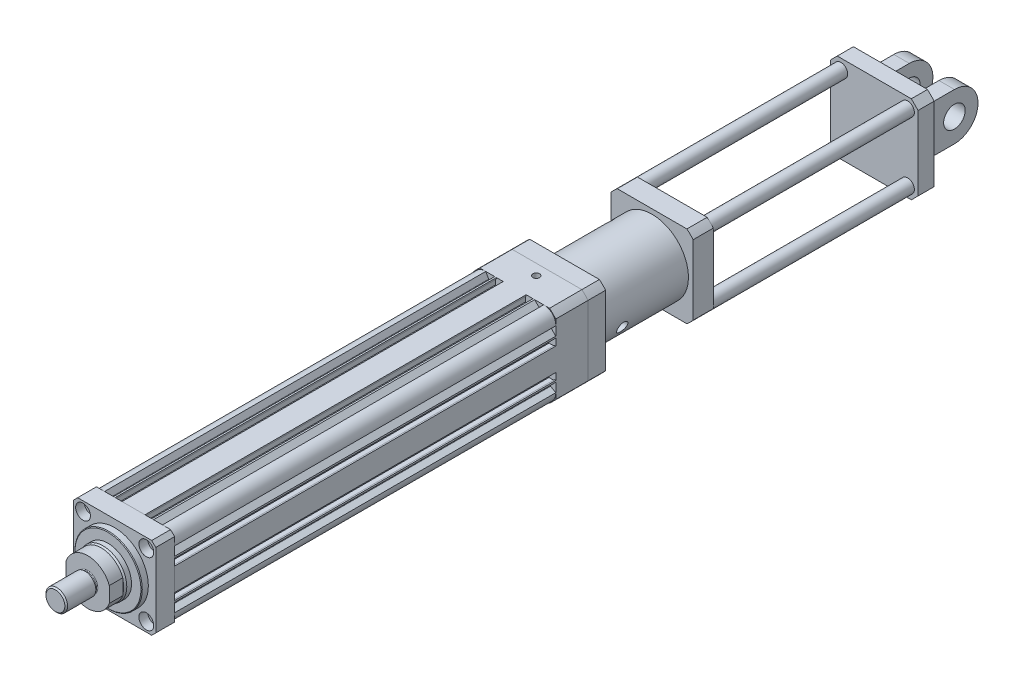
from build123d import *

# Parameters (mm, degrees)
SKETCH_1_R           = 25
SKETCH_1_R_2         = 2.594
EXTRUDE_1_DEPTH      = 283
EXTRUDE_1_2_DEPTH    = 14
SKETCH_3_R           = 4.5
SKETCH_3_R_2         = 3.5
CUT_EXTRUDE_3_DEPTH  = 14
SKETCH_3_5_R         = 5.5
CUT_EXTRUDE_4_DEPTH  = 6.5
SKETCH_5_R           = 25
EXTRUDE_2_DEPTH      = 5
CHAMFER_1_SIZE       = 0.5
SKETCH_6_R           = 17.5
EXTRUDE_3_DEPTH      = 5
CHAMFER_2_SIZE       = 1.5
CHAMFER_2_SIZE2      = 0.8
EXTRUDE_4_DEPTH      = 10
SKETCH_8_R           = 7
EXTRUDE_5_DEPTH      = 2
SKETCH_9_R           = 8
EXTRUDE_6_DEPTH      = 22
CHAMFER_3_SIZE       = 1
FILLET_1_R           = 0.5
SKETCH_10_W          = 61
SKETCH_10_H          = 61
EXTRUDE_7_DEPTH      = 24
SKETCH_11_R          = 50
SKETCH_11_R_2        = 40
CUT_EXTRUDE_1_DEPTH  = 24
SKETCH_16_W          = 61
SKETCH_16_H          = 61
EXTRUDE_8_DEPTH      = 13
SKETCH_18_R          = 3.5
CUT_EXTRUDE_5_DEPTH  = 13
SKETCH_19_R          = 27
EXTRUDE_9_DEPTH      = 65
SKETCH_20_W          = 61
SKETCH_20_H          = 61
EXTRUDE_10_DEPTH     = 15
SKETCH_21_R          = 2.5
CUT_EXTRUDE_6_DEPTH  = 10
SKETCH_22_R          = 50
SKETCH_22_R_2        = 40
CUT_EXTRUDE_2_DEPTH  = 93
SKETCH_23_R          = 21
CUT_EXTRUDE_7_DEPTH  = 80
SKETCH_23_3_R        = 25
CUT_EXTRUDE_8_DEPTH  = 7
SKETCH_24_R          = 4
CUT_EXTRUDE_9_DEPTH  = 27
SKETCH_25_R          = 4
CUT_EXTRUDE_10_DEPTH = 27
SKETCH_26_R          = 25
EXTRUDE_11_DEPTH     = 1
EXTRUDE_START        = 150
SKETCH_27_W          = 65
SKETCH_27_H          = 65
EXTRUDE_12_DEPTH     = 12
SKETCH_28_R          = 5
EXTRUDE_13_DEPTH     = 150
EXTRUDE_13_2_DEPTH   = 150
EXTRUDE_13_3_DEPTH   = 150
EXTRUDE_13_4_DEPTH   = 150
SKETCH_29_W          = 11.5
SKETCH_29_H          = 35
EXTRUDE_14_DEPTH     = 42.5
SKETCH_30_R          = 8
CUT_EXTRUDE_11_DEPTH = 52.5
CHAMFER_4_SIZE       = 2
CHAMFER_5_SIZE       = 5


with BuildPart() as part:
    # Sketch 1 → Extrude 1 (new body)
    with BuildSketch(Plane.XY):
        with BuildLine():
            Line((30.5, 8.5), (29.5, 8.5))
            Line((29.5, 8.5), (29.5, 7.9))
            Line((29.5, 7.9), (25.5, 7.9))
            Line((25.5, 7.9), (25.5, 14.2))
            Line((25.5, 14.2), (29.5, 14.2))
            Line((29.5, 14.2), (29.5, 13.6))
            Line((29.5, 13.6), (30.5, 13.6))
            Line((30.5, 13.6), (30.5, 14.843551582))
            Line((30.5, 14.843551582), (26.602512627, 18.741038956))
            ThreePointArc((26.602512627, 18.741038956), (26.502994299, 19.034210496), (26.675, 19.29163522))
            Line((26.675, 19.29163522), (30.5, 21.5))
            ThreePointArc((30.5, 21.5), (28.010599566, 28.010599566), (21.5, 30.5))
            Line((21.5, 30.5), (19.29163522, 26.675))
            ThreePointArc((19.29163522, 26.675), (19.034210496, 26.502994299), (18.741038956, 26.602512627))
            Line((18.741038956, 26.602512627), (14.843551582, 30.5))
            Line((14.843551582, 30.5), (13.6, 30.5))
            Line((13.6, 30.5), (13.6, 29.5))
            Line((13.6, 29.5), (14.2, 29.5))
            Line((14.2, 29.5), (14.2, 25.5))
            Line((14.2, 25.5), (7.9, 25.5))
            Line((7.9, 25.5), (7.9, 29.5))
            Line((7.9, 29.5), (8.5, 29.5))
            Line((8.5, 29.5), (8.5, 30.5))
            Line((8.5, 30.5), (-8.5, 30.5))
            Line((-8.5, 30.5), (-8.5, 29.5))
            Line((-8.5, 29.5), (-7.9, 29.5))
            Line((-7.9, 29.5), (-7.9, 25.5))
            Line((-7.9, 25.5), (-14.2, 25.5))
            Line((-14.2, 25.5), (-14.2, 29.5))
            Line((-14.2, 29.5), (-13.6, 29.5))
            Line((-13.6, 29.5), (-13.6, 30.5))
            Line((-13.6, 30.5), (-14.843551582, 30.5))
            Line((-14.843551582, 30.5), (-18.741038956, 26.602512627))
            ThreePointArc((-18.741038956, 26.602512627), (-19.034210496, 26.502994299), (-19.29163522, 26.675))
            Line((-19.29163522, 26.675), (-21.5, 30.5))
            ThreePointArc((-21.5, 30.5), (-28.010599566, 28.010599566), (-30.5, 21.5))
            Line((-30.5, 21.5), (-26.675, 19.29163522))
            ThreePointArc((-26.675, 19.29163522), (-26.502994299, 19.034210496), (-26.602512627, 18.741038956))
            Line((-26.602512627, 18.741038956), (-30.5, 14.843551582))
            Line((-30.5, 14.843551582), (-30.5, 13.6))
            Line((-30.5, 13.6), (-29.5, 13.6))
            Line((-29.5, 13.6), (-29.5, 14.2))
            Line((-29.5, 14.2), (-25.5, 14.2))
            Line((-25.5, 14.2), (-25.5, 7.9))
            Line((-25.5, 7.9), (-29.5, 7.9))
            Line((-29.5, 7.9), (-29.5, 8.5))
            Line((-29.5, 8.5), (-30.5, 8.5))
            Line((-30.5, 8.5), (-30.5, -8.5))
            Line((-30.5, -8.5), (-29.5, -8.5))
            Line((-29.5, -8.5), (-29.5, -7.9))
            Line((-29.5, -7.9), (-25.5, -7.9))
            Line((-25.5, -7.9), (-25.5, -14.2))
            Line((-25.5, -14.2), (-29.5, -14.2))
            Line((-29.5, -14.2), (-29.5, -13.6))
            Line((-29.5, -13.6), (-30.5, -13.6))
            Line((-30.5, -13.6), (-30.5, -14.843551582))
            Line((-30.5, -14.843551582), (-26.602512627, -18.741038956))
            ThreePointArc((-26.602512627, -18.741038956), (-26.502994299, -19.034210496), (-26.675, -19.29163522))
            Line((-26.675, -19.29163522), (-30.5, -21.5))
            ThreePointArc((-30.5, -21.5), (-27.825897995, -28.191225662), (-21, -30.5))
            Line((-21, -30.5), (-18.79163522, -26.675))
            ThreePointArc((-18.79163522, -26.675), (-18.534210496, -26.502994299), (-18.241038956, -26.602512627))
            Line((-18.241038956, -26.602512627), (-14.343551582, -30.5))
            Line((-14.343551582, -30.5), (14.343551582, -30.5))
            Line((14.343551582, -30.5), (18.241038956, -26.602512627))
            ThreePointArc((18.241038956, -26.602512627), (18.534210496, -26.502994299), (18.79163522, -26.675))
            Line((18.79163522, -26.675), (21, -30.5))
            ThreePointArc((21, -30.5), (27.825897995, -28.191225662), (30.5, -21.5))
            Line((30.5, -21.5), (26.675, -19.29163522))
            ThreePointArc((26.675, -19.29163522), (26.502994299, -19.034210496), (26.602512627, -18.741038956))
            Line((26.602512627, -18.741038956), (30.5, -14.843551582))
            Line((30.5, -14.843551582), (30.5, -13.6))
            Line((30.5, -13.6), (29.5, -13.6))
            Line((29.5, -13.6), (29.5, -14.2))
            Line((29.5, -14.2), (25.5, -14.2))
            Line((25.5, -14.2), (25.5, -7.9))
            Line((25.5, -7.9), (29.5, -7.9))
            Line((29.5, -7.9), (29.5, -8.5))
            Line((29.5, -8.5), (30.5, -8.5))
            Line((30.5, -8.5), (30.5, 8.5))
        make_face()
        Circle(SKETCH_1_R, mode=Mode.SUBTRACT)
        with Locations((23.5, -23.5)):
            Circle(SKETCH_1_R_2, mode=Mode.SUBTRACT)
        with Locations((-23.5, -23.5)):
            Circle(SKETCH_1_R_2, mode=Mode.SUBTRACT)
        with Locations((23.5, 23.5)):
            Circle(SKETCH_1_R_2, mode=Mode.SUBTRACT)
        with Locations((-23.5, 23.5)):
            Circle(SKETCH_1_R_2, mode=Mode.SUBTRACT)
        with BuildLine():
            Line((-14.843484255, -26.551505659), (-5.699422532, -26.551505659))
            ThreePointArc((-5.699422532, -26.551505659), (-5.401016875, -26.282393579), (-5.637974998, -25.957866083))
            ThreePointArc((-5.637974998, -25.957866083), (-10.496775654, -24.470016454), (-15.006657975, -22.128520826))
            ThreePointArc((-15.006657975, -22.128520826), (-15.31244973, -22.117932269), (-15.468484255, -22.381131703))
            Line((-15.468484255, -22.381131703), (-15.468484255, -25.926505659))
            Line((-15.468484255, -25.926505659), (-14.843484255, -26.551505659))
        make_face(mode=Mode.SUBTRACT)
        with BuildLine():
            Line((15.037740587, -26.551505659), (5.893678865, -26.551505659))
            ThreePointArc((5.893678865, -26.551505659), (5.595273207, -26.282393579), (5.832231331, -25.957866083))
            ThreePointArc((5.832231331, -25.957866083), (10.691031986, -24.470016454), (15.200914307, -22.128520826))
            ThreePointArc((15.200914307, -22.128520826), (15.506706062, -22.117932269), (15.662740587, -22.381131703))
            Line((15.662740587, -22.381131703), (15.662740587, -25.926505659))
            Line((15.662740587, -25.926505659), (15.037740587, -26.551505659))
        make_face(mode=Mode.SUBTRACT)
        with BuildLine():
            Line((24.057261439, -13.884764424), (23.358946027, -13.481591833))
            ThreePointArc((23.358946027, -13.481591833), (23.055418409, -13.441631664), (22.812535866, -13.628001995))
            Line((22.812535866, -13.628001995), (21.480305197, -15.935493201))
            ThreePointArc((21.480305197, -15.935493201), (21.440345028, -16.239020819), (21.626715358, -16.481903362))
            Line((21.626715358, -16.481903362), (22.892186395, -17.212523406))
            ThreePointArc((22.892186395, -17.212523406), (23.195714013, -17.252483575), (23.438596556, -17.066113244))
            Line((23.438596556, -17.066113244), (24.274264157, -15.618694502))
            ThreePointArc((24.274264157, -15.618694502), (24.317966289, -15.507082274), (24.326638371, -15.387533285))
            Line((24.326638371, -15.387533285), (24.223757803, -14.070923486))
            ThreePointArc((24.223757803, -14.070923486), (24.155411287, -13.964516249), (24.057261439, -13.884764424))
        make_face(mode=Mode.SUBTRACT)
        with BuildLine():
            Line((-24.057261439, -13.884764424), (-23.358946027, -13.481591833))
            ThreePointArc((-23.358946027, -13.481591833), (-23.055418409, -13.441631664), (-22.812535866, -13.628001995))
            Line((-22.812535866, -13.628001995), (-21.480305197, -15.935493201))
            ThreePointArc((-21.480305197, -15.935493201), (-21.440345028, -16.239020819), (-21.626715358, -16.481903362))
            Line((-21.626715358, -16.481903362), (-22.892186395, -17.212523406))
            ThreePointArc((-22.892186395, -17.212523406), (-23.195714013, -17.252483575), (-23.438596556, -17.066113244))
            Line((-23.438596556, -17.066113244), (-24.274264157, -15.618694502))
            ThreePointArc((-24.274264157, -15.618694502), (-24.317966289, -15.507082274), (-24.326638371, -15.387533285))
            Line((-24.326638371, -15.387533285), (-24.223757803, -14.070923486))
            ThreePointArc((-24.223757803, -14.070923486), (-24.155411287, -13.964516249), (-24.057261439, -13.884764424))
        make_face(mode=Mode.SUBTRACT)
        with BuildLine():
            Line((24.057261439, 13.884764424), (23.358946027, 13.481591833))
            ThreePointArc((23.358946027, 13.481591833), (23.055418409, 13.441631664), (22.812535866, 13.628001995))
            Line((22.812535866, 13.628001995), (21.480305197, 15.935493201))
            ThreePointArc((21.480305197, 15.935493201), (21.440345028, 16.239020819), (21.626715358, 16.481903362))
            Line((21.626715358, 16.481903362), (22.892186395, 17.212523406))
            ThreePointArc((22.892186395, 17.212523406), (23.195714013, 17.252483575), (23.438596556, 17.066113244))
            Line((23.438596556, 17.066113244), (24.274264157, 15.618694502))
            ThreePointArc((24.274264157, 15.618694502), (24.317966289, 15.507082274), (24.326638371, 15.387533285))
            Line((24.326638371, 15.387533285), (24.223757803, 14.070923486))
            ThreePointArc((24.223757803, 14.070923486), (24.155411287, 13.964516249), (24.057261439, 13.884764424))
        make_face(mode=Mode.SUBTRACT)
        with BuildLine():
            Line((-24.057261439, 13.884764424), (-23.358946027, 13.481591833))
            ThreePointArc((-23.358946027, 13.481591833), (-23.055418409, 13.441631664), (-22.812535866, 13.628001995))
            Line((-22.812535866, 13.628001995), (-21.480305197, 15.935493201))
            ThreePointArc((-21.480305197, 15.935493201), (-21.440345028, 16.239020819), (-21.626715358, 16.481903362))
            Line((-21.626715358, 16.481903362), (-22.892186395, 17.212523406))
            ThreePointArc((-22.892186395, 17.212523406), (-23.195714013, 17.252483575), (-23.438596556, 17.066113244))
            Line((-23.438596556, 17.066113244), (-24.274264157, 15.618694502))
            ThreePointArc((-24.274264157, 15.618694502), (-24.317966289, 15.507082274), (-24.326638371, 15.387533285))
            Line((-24.326638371, 15.387533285), (-24.223757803, 14.070923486))
            ThreePointArc((-24.223757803, 14.070923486), (-24.155411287, 13.964516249), (-24.057261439, 13.884764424))
        make_face(mode=Mode.SUBTRACT)
        with BuildLine():
            Line((17.761634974, 23.75411276), (17.07315308, 24.68624059))
            ThreePointArc((17.07315308, 24.68624059), (16.934629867, 24.812286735), (16.758415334, 24.87572765))
            Line((16.758415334, 24.87572765), (13.966108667, 25.295529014))
            ThreePointArc((13.966108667, 25.295529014), (13.689318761, 25.25468305), (13.482325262, 25.066441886))
            Line((13.482325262, 25.066441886), (12.839111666, 23.986237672))
            ThreePointArc((12.839111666, 23.986237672), (12.785382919, 23.626185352), (12.999780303, 23.331977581))
            ThreePointArc((12.999780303, 23.331977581), (14.833000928, 22.112125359), (16.576342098, 20.766949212))
            ThreePointArc((16.576342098, 20.766949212), (17.053890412, 20.688035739), (17.357364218, 21.065107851))
            Line((17.357364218, 21.065107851), (17.761634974, 23.75411276))
        make_face(mode=Mode.SUBTRACT)
        with BuildLine():
            Line((-17.761634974, 23.75411276), (-17.07315308, 24.68624059))
            ThreePointArc((-17.07315308, 24.68624059), (-16.934629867, 24.812286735), (-16.758415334, 24.87572765))
            Line((-16.758415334, 24.87572765), (-13.966108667, 25.295529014))
            ThreePointArc((-13.966108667, 25.295529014), (-13.689318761, 25.25468305), (-13.482325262, 25.066441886))
            Line((-13.482325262, 25.066441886), (-12.839111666, 23.986237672))
            ThreePointArc((-12.839111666, 23.986237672), (-12.785382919, 23.626185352), (-12.999780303, 23.331977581))
            ThreePointArc((-12.999780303, 23.331977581), (-14.833000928, 22.112125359), (-16.576342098, 20.766949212))
            ThreePointArc((-16.576342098, 20.766949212), (-17.053890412, 20.688035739), (-17.357364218, 21.065107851))
            Line((-17.357364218, 21.065107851), (-17.761634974, 23.75411276))
        make_face(mode=Mode.SUBTRACT)
    extrude(amount=EXTRUDE_1_DEPTH)

    # Sketch 10 → Extrude 7 (add)
    with BuildSketch(Plane(origin=(0, 0, 0), x_dir=(-1, 0, 0), z_dir=(0, 0, -1))):
        Rectangle(SKETCH_10_W, SKETCH_10_H)
    extrude(amount=EXTRUDE_7_DEPTH)

    # Sketch 11 → Cut-Extrude 1 (cut)
    with BuildSketch(Plane(origin=(0, 0, -24), x_dir=(-1, 0, 0), z_dir=(0, 0, -1))):
        Circle(SKETCH_11_R)
        Circle(SKETCH_11_R_2, mode=Mode.SUBTRACT)
    extrude(amount=-CUT_EXTRUDE_1_DEPTH, mode=Mode.SUBTRACT)

    # Sketch 15 → Hole Wizard M6 _1 (revolve, cut)
    with BuildSketch(Plane(origin=(0, 30.5, -16), x_dir=(0, 0, 1), z_dir=(1, 0, 0))):
        Polygon((0, 0), (0, 9.502151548), (2.5, 8), (2.5, 0), align=None)
    revolve(axis=Axis((0, 36.85, -16), (0, -1, 0)), mode=Mode.SUBTRACT)


with BuildPart() as body_2:
    # Sketch 2 → Extrude 1 2 (new body)
    with BuildSketch(Plane.XY.offset(283)):
        Polygon((-27.5, 30.5), (-30.5, 27.5), (-30.5, -27.5), (-27.5, -30.5), (27.5, -30.5), (30.5, -27.5), (30.5, 27.5), (27.5, 30.5), align=None)
    extrude(amount=EXTRUDE_1_2_DEPTH)

    # Sketch 3 → Cut-Extrude 3 (cut)
    with BuildSketch(Plane.XY.offset(297)):
        with Locations((-40, -20)):
            Circle(SKETCH_3_R)
        with Locations((-23.5, -23.5)):
            Circle(SKETCH_3_R_2)
        with Locations((-23.5, 23.5)):
            Circle(SKETCH_3_R_2)
        with Locations((23.5, 23.5)):
            Circle(SKETCH_3_R_2)
        with Locations((40, 20)):
            Circle(SKETCH_3_R)
        with Locations((40, -20)):
            Circle(SKETCH_3_R)
        with Locations((23.5, -23.5)):
            Circle(SKETCH_3_R_2)
        with Locations((-40, 20)):
            Circle(SKETCH_3_R)
    extrude(amount=-CUT_EXTRUDE_3_DEPTH, mode=Mode.SUBTRACT)

    # Sketch 3_5 → Cut-Extrude 4 (cut)
    with BuildSketch(Plane.XY.offset(297)):
        with Locations((-23.5, 23.5)):
            Circle(SKETCH_3_5_R)
        with Locations((-23.5, -23.5)):
            Circle(SKETCH_3_5_R)
        with Locations((23.5, -23.5)):
            Circle(SKETCH_3_5_R)
        with Locations((23.5, 23.5)):
            Circle(SKETCH_3_5_R)
    extrude(amount=-CUT_EXTRUDE_4_DEPTH, mode=Mode.SUBTRACT)

    # Sketch 5 → Extrude 2 (add)
    with BuildSketch(Plane.XY.offset(297)):
        Circle(SKETCH_5_R)
    extrude(amount=EXTRUDE_2_DEPTH)

    # Chamfer 1
    chamfer_1_edges = [body_2.edges().sort_by_distance(p)[0] for p in [
        (-25, 0, 302),
    ]]
    chamfer(chamfer_1_edges, length=CHAMFER_1_SIZE)

    # Sketch 6 → Extrude 3 (add)
    with BuildSketch(Plane.XY.offset(302)):
        Circle(SKETCH_6_R)
    extrude(amount=EXTRUDE_3_DEPTH)

    # Chamfer 2
    chamfer_2_edges = [body_2.edges().sort_by_distance(p)[0] for p in [
        (-17.5, 0, 307),
    ]]
    chamfer_2_side = [body_2.faces().sort_by_distance(p)[0] for p in [
        (-17.5, 0, 304.5),
    ]]
    chamfer(chamfer_2_edges, length=CHAMFER_2_SIZE, length2=CHAMFER_2_SIZE2, reference=chamfer_2_side[0])

    # Sketch 7 → Extrude 4 (add)
    with BuildSketch(Plane.XY.offset(307)):
        with BuildLine():
            Line((-16, 5.744562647), (-16, -5.744562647))
            ThreePointArc((-16, -5.744562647), (0, -17), (16, -5.744562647))
            Line((16, -5.744562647), (16, 5.744562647))
            ThreePointArc((16, 5.744562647), (0, 17), (-16, 5.744562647))
        make_face()
    extrude(amount=EXTRUDE_4_DEPTH)

    # Sketch 8 → Extrude 5 (add)
    with BuildSketch(Plane.XY.offset(317)):
        Circle(SKETCH_8_R)
    extrude(amount=EXTRUDE_5_DEPTH)

    # Sketch 9 → Extrude 6 (add)
    with BuildSketch(Plane.XY.offset(319)):
        Circle(SKETCH_9_R)
    extrude(amount=EXTRUDE_6_DEPTH)

    # Chamfer 3
    chamfer_3_edges = [body_2.edges().sort_by_distance(p)[0] for p in [
        (-8, 0, 341),
    ]]
    chamfer(chamfer_3_edges, length=CHAMFER_3_SIZE)

    # Fillet 1
    fillet_1_edges = [body_2.edges().sort_by_distance(p)[0] for p in [
        (-7, 0, 317),
    ]]
    fillet(fillet_1_edges, radius=FILLET_1_R)


with BuildPart() as body_3:
    # Sketch 16 → Extrude 8 (new body)
    with BuildSketch(Plane(origin=(0, 0, -24), x_dir=(-1, 0, 0), z_dir=(0, 0, -1))):
        Rectangle(SKETCH_16_W, SKETCH_16_H)
    extrude(amount=EXTRUDE_8_DEPTH)

    # Sketch 18 → Cut-Extrude 5 (cut)
    with BuildSketch(Plane(origin=(0, 0, -37), x_dir=(-1, 0, 0), z_dir=(0, 0, -1))):
        with Locations((-23.5, 23.5)):
            Circle(SKETCH_18_R)
        with Locations((-23.5, -23.5)):
            Circle(SKETCH_18_R)
        with Locations((23.5, -23.5)):
            Circle(SKETCH_18_R)
        with Locations((23.5, 23.5)):
            Circle(SKETCH_18_R)
    extrude(amount=-CUT_EXTRUDE_5_DEPTH, mode=Mode.SUBTRACT)

    # Sketch 19 → Extrude 9 (add)
    with BuildSketch(Plane(origin=(0, 0, -37), x_dir=(-1, 0, 0), z_dir=(0, 0, -1))):
        Circle(SKETCH_19_R)
    extrude(amount=EXTRUDE_9_DEPTH)

    # Sketch 20 → Extrude 10 (add)
    with BuildSketch(Plane(origin=(0, 0, -102), x_dir=(-1, 0, 0), z_dir=(0, 0, -1))):
        Rectangle(SKETCH_20_W, SKETCH_20_H)
    extrude(amount=EXTRUDE_10_DEPTH)

    # Sketch 21 → Cut-Extrude 6 (cut)
    with BuildSketch(Plane(origin=(0, 0, -117), x_dir=(-1, 0, 0), z_dir=(0, 0, -1))):
        with Locations((-24.748737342, 24.748737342)):
            Circle(SKETCH_21_R)
        with Locations((24.748737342, 24.748737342)):
            Circle(SKETCH_21_R)
        with Locations((24.748737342, -24.748737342)):
            Circle(SKETCH_21_R)
        with Locations((-24.748737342, -24.748737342)):
            Circle(SKETCH_21_R)
    extrude(amount=-CUT_EXTRUDE_6_DEPTH, mode=Mode.SUBTRACT)

    # Sketch 22 → Cut-Extrude 2 (cut)
    with BuildSketch(Plane(origin=(0, 0, -117), x_dir=(-1, 0, 0), z_dir=(0, 0, -1))):
        Circle(SKETCH_22_R)
        Circle(SKETCH_22_R_2, mode=Mode.SUBTRACT)
    extrude(amount=-CUT_EXTRUDE_2_DEPTH, mode=Mode.SUBTRACT)

    # Sketch 23 → Cut-Extrude 7 (cut)
    with BuildSketch(Plane(origin=(0, 0, -117), x_dir=(-1, 0, 0), z_dir=(0, 0, -1))):
        Circle(SKETCH_23_R)
    extrude(amount=-CUT_EXTRUDE_7_DEPTH, mode=Mode.SUBTRACT)

    # Sketch 23_3 → Cut-Extrude 8 (cut)
    with BuildSketch(Plane(origin=(0, 0, -117), x_dir=(-1, 0, 0), z_dir=(0, 0, -1))):
        Circle(SKETCH_23_3_R)
    extrude(amount=-CUT_EXTRUDE_8_DEPTH, mode=Mode.SUBTRACT)

    # Sketch 24 → Cut-Extrude 9 (cut)
    with BuildSketch(Plane.ZY.offset(30.5)):
        with Locations(Location((-88.78323725, 17.446251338, 0), (0, 0, 270))):
            Circle(SKETCH_24_R)
    extrude(amount=-CUT_EXTRUDE_9_DEPTH, mode=Mode.SUBTRACT)

    # Sketch 25 → Cut-Extrude 10 (cut)
    with BuildSketch(Plane(origin=(30.5, 0, 0), x_dir=(0, 0, -1), z_dir=(1, 0, 0))):
        with Locations((54.542092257, -9.414024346)):
            Circle(SKETCH_25_R)
    extrude(amount=-CUT_EXTRUDE_10_DEPTH, mode=Mode.SUBTRACT)

    # Sketch 26 → Extrude 11 (add)
    with BuildSketch(Plane(origin=(0, 0, -117), x_dir=(-1, 0, 0), z_dir=(0, 0, -1))):
        Circle(SKETCH_26_R)
    extrude(amount=-EXTRUDE_11_DEPTH)


with BuildPart() as body_4:
    # Sketch 27 → Extrude 12 (new body)
    with BuildSketch(Plane(origin=(0, 0, -117), x_dir=(-1, 0, 0), z_dir=(0, 0, -1)).offset(EXTRUDE_START)):
        Rectangle(SKETCH_27_W, SKETCH_27_H)
    extrude(amount=EXTRUDE_12_DEPTH)

    # Sketch 29 → Extrude 14 (add)
    with BuildSketch(Plane(origin=(0, 0, -279), x_dir=(-1, 0, 0), z_dir=(0, 0, -1))):
        with Locations((-16.75, 0)):
            Rectangle(SKETCH_29_W, SKETCH_29_H)
        with Locations((16.75, 0)):
            Rectangle(SKETCH_29_W, SKETCH_29_H)
    extrude(amount=EXTRUDE_14_DEPTH)

    # Sketch 30 → Cut-Extrude 11 (cut)
    with BuildSketch(Plane.ZY.offset(22.5)):
        with Locations(Location((-304, 0, 0), (0, 0, 270))):
            Circle(SKETCH_30_R)
        with BuildLine():
            Line((-304, 17.5), (-348.351562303, 26.18407124))
            Line((-348.351562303, 26.18407124), (-337.93682449, -30.61375815))
            Line((-337.93682449, -30.61375815), (-304, -17.5))
            ThreePointArc((-304, -17.5), (-321.5, 0), (-304, 17.5))
        make_face()
    extrude(amount=-CUT_EXTRUDE_11_DEPTH, mode=Mode.SUBTRACT)

    # Chamfer 4
    chamfer_4_edges = [body_4.edges().sort_by_distance(p)[0] for p in [
        (11, 0, -279),
        (16.75, 17.5, -279),
        (22.5, 0, -279),
        (16.75, -17.5, -279),
        (-22.5, 0, -279),
        (-16.75, 17.5, -279),
        (-11, 0, -279),
        (-16.75, -17.5, -279),
    ]]
    chamfer(chamfer_4_edges, length=CHAMFER_4_SIZE)

    # Chamfer 5
    chamfer_5_edges = [body_4.edges().sort_by_distance(p)[0] for p in [
        (-32.5, -32.5, -273),
        (32.5, -32.5, -273),
        (32.5, 32.5, -273),
        (-32.5, 32.5, -273),
    ]]
    chamfer(chamfer_5_edges, length=CHAMFER_5_SIZE)


with BuildPart() as body_5:
    # Sketch 28 → Extrude 13 (new body)
    with BuildSketch(Plane(origin=(0, 0, -117), x_dir=(-1, 0, 0), z_dir=(0, 0, -1))):
        with Locations((-24.748737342, 24.748737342)):
            Circle(SKETCH_28_R)
    extrude(amount=EXTRUDE_13_DEPTH)


with BuildPart() as body_6:
    # Sketch 28 → Extrude 13 2 (new body)
    with BuildSketch(Plane(origin=(0, 0, -117), x_dir=(-1, 0, 0), z_dir=(0, 0, -1))):
        with Locations((24.748737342, 24.748737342)):
            Circle(SKETCH_28_R)
    extrude(amount=EXTRUDE_13_2_DEPTH)


with BuildPart() as body_7:
    # Sketch 28 → Extrude 13 3 (new body)
    with BuildSketch(Plane(origin=(0, 0, -117), x_dir=(-1, 0, 0), z_dir=(0, 0, -1))):
        with Locations((24.748737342, -24.748737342)):
            Circle(SKETCH_28_R)
    extrude(amount=EXTRUDE_13_3_DEPTH)


with BuildPart() as body_8:
    # Sketch 28 → Extrude 13 4 (new body)
    with BuildSketch(Plane(origin=(0, 0, -117), x_dir=(-1, 0, 0), z_dir=(0, 0, -1))):
        with Locations((-24.748737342, -24.748737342)):
            Circle(SKETCH_28_R)
    extrude(amount=EXTRUDE_13_4_DEPTH)


solid = Compound([part.part, body_2.part, body_3.part, body_4.part, body_5.part, body_6.part, body_7.part, body_8.part])
